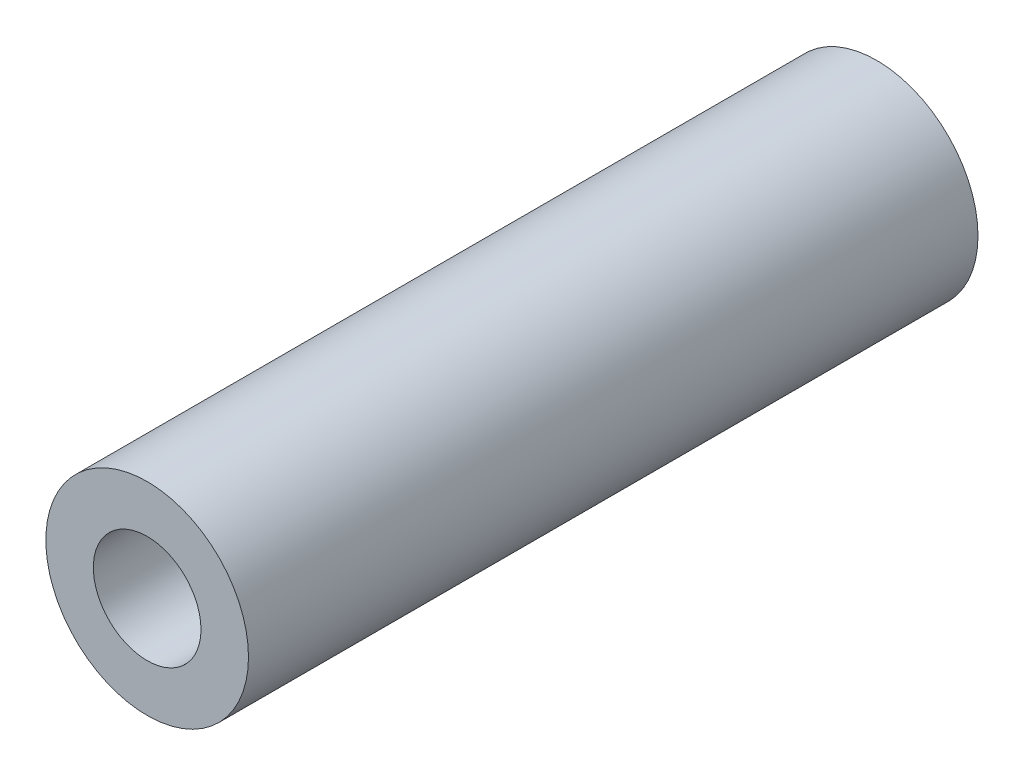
ISO-10303-21;
HEADER;
FILE_DESCRIPTION(('STEP AP214'),'2;1');
FILE_NAME('part.step','',(''),(''),'','','');
FILE_SCHEMA(('AUTOMOTIVE_DESIGN { 1 0 10303 214 1 1 1 1 }'));
ENDSEC;
DATA;
#1=APPLICATION_CONTEXT('core data for automotive mechanical design processes');
#2=APPLICATION_PROTOCOL_DEFINITION('international standard','automotive_design',2000,#1);
#3=PRODUCT_CONTEXT('',#1,'mechanical');
#4=PRODUCT('Part','Part','',(#3));
#5=PRODUCT_RELATED_PRODUCT_CATEGORY('part','',(#4));
#6=PRODUCT_DEFINITION_FORMATION('','',#4);
#7=PRODUCT_DEFINITION_CONTEXT('part definition',#1,'design');
#8=PRODUCT_DEFINITION('design','',#6,#7);
#9=PRODUCT_DEFINITION_SHAPE('','',#8);
#10=(LENGTH_UNIT() NAMED_UNIT(*) SI_UNIT(.MILLI.,.METRE.));
#11=(NAMED_UNIT(*) PLANE_ANGLE_UNIT() SI_UNIT($,.RADIAN.));
#12=(NAMED_UNIT(*) SI_UNIT($,.STERADIAN.) SOLID_ANGLE_UNIT());
#13=UNCERTAINTY_MEASURE_WITH_UNIT(LENGTH_MEASURE(1.E-05),#10,'distance_accuracy_value','');
#14=(GEOMETRIC_REPRESENTATION_CONTEXT(3) GLOBAL_UNCERTAINTY_ASSIGNED_CONTEXT((#13)) GLOBAL_UNIT_ASSIGNED_CONTEXT((#10,
#11,#12)) REPRESENTATION_CONTEXT('',''));
#15=CARTESIAN_POINT('',(0.,0.,0.));
#16=DIRECTION('',(0.,0.,1.));
#17=DIRECTION('',(1.,0.,0.));
#18=AXIS2_PLACEMENT_3D('',#15,#16,#17);
#19=CARTESIAN_POINT('',(0.,0.,14.2875));
#20=DIRECTION('',(0.,0.,1.));
#21=DIRECTION('',(1.,0.,0.));
#22=AXIS2_PLACEMENT_3D('',#19,#20,#21);
#23=PLANE('',#22);
#24=CARTESIAN_POINT('',(0.,0.,14.2875));
#25=DIRECTION('',(0.,0.,1.));
#26=DIRECTION('',(1.,0.,0.));
#27=AXIS2_PLACEMENT_3D('',#24,#25,#26);
#28=CIRCLE('',#27,3.96875);
#29=CARTESIAN_POINT('',(3.96875,0.,14.2875));
#30=VERTEX_POINT('',#29);
#31=EDGE_CURVE('E10',#30,#30,#28,.T.);
#32=ORIENTED_EDGE('',*,*,#31,.T.);
#33=EDGE_LOOP('',(#32));
#34=FACE_BOUND('',#33,.T.);
#35=CARTESIAN_POINT('',(0.,0.,14.2875));
#36=DIRECTION('',(0.,0.,1.));
#37=DIRECTION('',(1.,0.,0.));
#38=AXIS2_PLACEMENT_3D('',#35,#36,#37);
#39=CIRCLE('',#38,2.1082);
#40=CARTESIAN_POINT('',(2.1082,0.,14.2875));
#41=VERTEX_POINT('',#40);
#42=EDGE_CURVE('E40',#41,#41,#39,.T.);
#43=ORIENTED_EDGE('',*,*,#42,.F.);
#44=EDGE_LOOP('',(#43));
#45=FACE_BOUND('',#44,.T.);
#46=ADVANCED_FACE('F29',(#34,#45),#23,.T.);
#47=CARTESIAN_POINT('',(0.,0.,-14.2875));
#48=DIRECTION('',(0.,0.,1.));
#49=DIRECTION('',(1.,0.,0.));
#50=AXIS2_PLACEMENT_3D('',#47,#48,#49);
#51=PLANE('',#50);
#52=CARTESIAN_POINT('',(0.,0.,-14.2875));
#53=DIRECTION('',(0.,0.,1.));
#54=DIRECTION('',(1.,0.,0.));
#55=AXIS2_PLACEMENT_3D('',#52,#53,#54);
#56=CIRCLE('',#55,3.96875);
#57=CARTESIAN_POINT('',(3.96875,0.,-14.2875));
#58=VERTEX_POINT('',#57);
#59=EDGE_CURVE('E33',#58,#58,#56,.T.);
#60=ORIENTED_EDGE('',*,*,#59,.F.);
#61=EDGE_LOOP('',(#60));
#62=FACE_BOUND('',#61,.T.);
#63=CARTESIAN_POINT('',(0.,0.,-14.2875));
#64=DIRECTION('',(0.,0.,1.));
#65=DIRECTION('',(1.,0.,0.));
#66=AXIS2_PLACEMENT_3D('',#63,#64,#65);
#67=CIRCLE('',#66,2.1082);
#68=CARTESIAN_POINT('',(2.1082,0.,-14.2875));
#69=VERTEX_POINT('',#68);
#70=EDGE_CURVE('E42',#69,#69,#67,.T.);
#71=ORIENTED_EDGE('',*,*,#70,.T.);
#72=EDGE_LOOP('',(#71));
#73=FACE_BOUND('',#72,.T.);
#74=ADVANCED_FACE('F52',(#62,#73),#51,.F.);
#75=CARTESIAN_POINT('',(0.,0.,14.2875));
#76=DIRECTION('',(0.,0.,-1.));
#77=DIRECTION('',(-1.,0.,0.));
#78=AXIS2_PLACEMENT_3D('',#75,#76,#77);
#79=CYLINDRICAL_SURFACE('',#78,3.96875);
#80=ORIENTED_EDGE('',*,*,#31,.F.);
#81=EDGE_LOOP('',(#80));
#82=FACE_BOUND('',#81,.T.);
#83=ORIENTED_EDGE('',*,*,#59,.T.);
#84=EDGE_LOOP('',(#83));
#85=FACE_BOUND('',#84,.T.);
#86=ADVANCED_FACE('F31',(#82,#85),#79,.T.);
#87=CARTESIAN_POINT('',(0.,0.,14.2875));
#88=DIRECTION('',(0.,0.,-1.));
#89=DIRECTION('',(-1.,0.,0.));
#90=AXIS2_PLACEMENT_3D('',#87,#88,#89);
#91=CYLINDRICAL_SURFACE('',#90,2.1082);
#92=ORIENTED_EDGE('',*,*,#42,.T.);
#93=EDGE_LOOP('',(#92));
#94=FACE_BOUND('',#93,.T.);
#95=ORIENTED_EDGE('',*,*,#70,.F.);
#96=EDGE_LOOP('',(#95));
#97=FACE_BOUND('',#96,.T.);
#98=ADVANCED_FACE('F48',(#94,#97),#91,.F.);
#99=CLOSED_SHELL('',(#46,#74,#86,#98));
#100=MANIFOLD_SOLID_BREP('B2',#99);
#101=ADVANCED_BREP_SHAPE_REPRESENTATION('',(#18,#100),#14);
#102=SHAPE_DEFINITION_REPRESENTATION(#9,#101);
ENDSEC;
END-ISO-10303-21;
